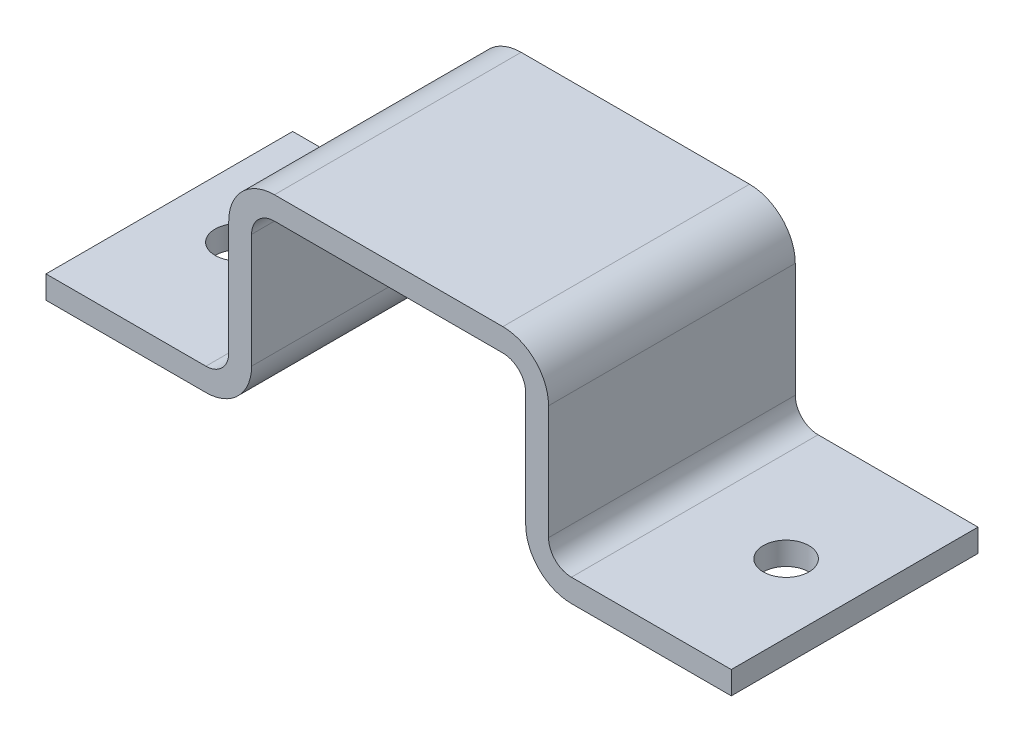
ISO-10303-21;
HEADER;
FILE_DESCRIPTION(('STEP AP214'),'2;1');
FILE_NAME('part.step','',(''),(''),'','','');
FILE_SCHEMA(('AUTOMOTIVE_DESIGN { 1 0 10303 214 1 1 1 1 }'));
ENDSEC;
DATA;
#1=APPLICATION_CONTEXT('core data for automotive mechanical design processes');
#2=APPLICATION_PROTOCOL_DEFINITION('international standard','automotive_design',2000,#1);
#3=PRODUCT_CONTEXT('',#1,'mechanical');
#4=PRODUCT('Part','Part','',(#3));
#5=PRODUCT_RELATED_PRODUCT_CATEGORY('part','',(#4));
#6=PRODUCT_DEFINITION_FORMATION('','',#4);
#7=PRODUCT_DEFINITION_CONTEXT('part definition',#1,'design');
#8=PRODUCT_DEFINITION('design','',#6,#7);
#9=PRODUCT_DEFINITION_SHAPE('','',#8);
#10=(LENGTH_UNIT() NAMED_UNIT(*) SI_UNIT(.MILLI.,.METRE.));
#11=(NAMED_UNIT(*) PLANE_ANGLE_UNIT() SI_UNIT($,.RADIAN.));
#12=(NAMED_UNIT(*) SI_UNIT($,.STERADIAN.) SOLID_ANGLE_UNIT());
#13=UNCERTAINTY_MEASURE_WITH_UNIT(LENGTH_MEASURE(1.E-05),#10,'distance_accuracy_value','');
#14=(GEOMETRIC_REPRESENTATION_CONTEXT(3) GLOBAL_UNCERTAINTY_ASSIGNED_CONTEXT((#13)) GLOBAL_UNIT_ASSIGNED_CONTEXT((#10,
#11,#12)) REPRESENTATION_CONTEXT('',''));
#15=CARTESIAN_POINT('',(0.,0.,0.));
#16=DIRECTION('',(0.,0.,1.));
#17=DIRECTION('',(1.,0.,0.));
#18=AXIS2_PLACEMENT_3D('',#15,#16,#17);
#19=CARTESIAN_POINT('',(40.,-40.,27.));
#20=DIRECTION('',(0.,1.,0.));
#21=DIRECTION('',(0.,0.,1.));
#22=AXIS2_PLACEMENT_3D('',#19,#20,#21);
#23=PLANE('',#22);
#24=CARTESIAN_POINT('',(60.,-40.,0.));
#25=DIRECTION('',(0.,1.,0.));
#26=DIRECTION('',(0.,0.,1.));
#27=AXIS2_PLACEMENT_3D('',#24,#25,#26);
#28=CIRCLE('',#27,5.);
#29=CARTESIAN_POINT('',(60.,-40.,5.));
#30=VERTEX_POINT('',#29);
#31=EDGE_CURVE('E369',#30,#30,#28,.T.);
#32=ORIENTED_EDGE('',*,*,#31,.T.);
#33=EDGE_LOOP('',(#32));
#34=FACE_BOUND('',#33,.T.);
#35=DIRECTION('',(1.,0.,0.));
#36=VECTOR('',#35,1.);
#37=CARTESIAN_POINT('',(40.,-40.,-27.));
#38=LINE('',#37,#36);
#39=CARTESIAN_POINT('',(40.,-40.,-27.));
#40=VERTEX_POINT('',#39);
#41=CARTESIAN_POINT('',(75.,-40.,-27.));
#42=VERTEX_POINT('',#41);
#43=EDGE_CURVE('E199',#40,#42,#38,.T.);
#44=ORIENTED_EDGE('',*,*,#43,.T.);
#45=DIRECTION('',(0.,0.,-1.));
#46=VECTOR('',#45,1.);
#47=CARTESIAN_POINT('',(75.,-40.,27.));
#48=LINE('',#47,#46);
#49=CARTESIAN_POINT('',(75.,-40.,27.));
#50=VERTEX_POINT('',#49);
#51=EDGE_CURVE('E11',#50,#42,#48,.T.);
#52=ORIENTED_EDGE('',*,*,#51,.F.);
#53=DIRECTION('',(1.,0.,0.));
#54=VECTOR('',#53,1.);
#55=CARTESIAN_POINT('',(40.,-40.,27.));
#56=LINE('',#55,#54);
#57=CARTESIAN_POINT('',(40.,-40.,27.));
#58=VERTEX_POINT('',#57);
#59=EDGE_CURVE('E124',#58,#50,#56,.T.);
#60=ORIENTED_EDGE('',*,*,#59,.F.);
#61=DIRECTION('',(0.,0.,-1.));
#62=VECTOR('',#61,1.);
#63=CARTESIAN_POINT('',(40.,-40.,27.));
#64=LINE('',#63,#62);
#65=EDGE_CURVE('E195',#58,#40,#64,.T.);
#66=ORIENTED_EDGE('',*,*,#65,.T.);
#67=EDGE_LOOP('',(#44,#52,#60,#66));
#68=FACE_BOUND('',#67,.T.);
#69=ADVANCED_FACE('F32',(#34,#68),#23,.F.);
#70=CARTESIAN_POINT('',(75.,-35.,27.));
#71=DIRECTION('',(1.,0.,0.));
#72=DIRECTION('',(0.,0.,-1.));
#73=AXIS2_PLACEMENT_3D('',#70,#71,#72);
#74=PLANE('',#73);
#75=DIRECTION('',(0.,-1.,0.));
#76=VECTOR('',#75,1.);
#77=CARTESIAN_POINT('',(75.,-35.,-27.));
#78=LINE('',#77,#76);
#79=CARTESIAN_POINT('',(75.,-35.,-27.));
#80=VERTEX_POINT('',#79);
#81=EDGE_CURVE('E202',#80,#42,#78,.T.);
#82=ORIENTED_EDGE('',*,*,#81,.F.);
#83=DIRECTION('',(0.,0.,-1.));
#84=VECTOR('',#83,1.);
#85=CARTESIAN_POINT('',(75.,-35.,27.));
#86=LINE('',#85,#84);
#87=CARTESIAN_POINT('',(75.,-35.,27.));
#88=VERTEX_POINT('',#87);
#89=EDGE_CURVE('E40',#88,#80,#86,.T.);
#90=ORIENTED_EDGE('',*,*,#89,.F.);
#91=DIRECTION('',(0.,-1.,0.));
#92=VECTOR('',#91,1.);
#93=CARTESIAN_POINT('',(75.,-35.,27.));
#94=LINE('',#93,#92);
#95=EDGE_CURVE('E305',#88,#50,#94,.T.);
#96=ORIENTED_EDGE('',*,*,#95,.T.);
#97=ORIENTED_EDGE('',*,*,#51,.T.);
#98=EDGE_LOOP('',(#82,#90,#96,#97));
#99=FACE_BOUND('',#98,.T.);
#100=ADVANCED_FACE('F292',(#99),#74,.T.);
#101=CARTESIAN_POINT('',(40.,-35.,27.));
#102=DIRECTION('',(0.,1.,0.));
#103=DIRECTION('',(0.,0.,1.));
#104=AXIS2_PLACEMENT_3D('',#101,#102,#103);
#105=PLANE('',#104);
#106=CARTESIAN_POINT('',(60.,-35.,0.));
#107=DIRECTION('',(0.,-1.,0.));
#108=DIRECTION('',(0.,0.,1.));
#109=AXIS2_PLACEMENT_3D('',#106,#107,#108);
#110=CIRCLE('',#109,5.);
#111=CARTESIAN_POINT('',(60.,-35.,5.));
#112=VERTEX_POINT('',#111);
#113=EDGE_CURVE('E371',#112,#112,#110,.T.);
#114=ORIENTED_EDGE('',*,*,#113,.T.);
#115=EDGE_LOOP('',(#114));
#116=FACE_BOUND('',#115,.T.);
#117=DIRECTION('',(1.,0.,0.));
#118=VECTOR('',#117,1.);
#119=CARTESIAN_POINT('',(40.,-35.,-27.));
#120=LINE('',#119,#118);
#121=CARTESIAN_POINT('',(40.,-35.,-27.));
#122=VERTEX_POINT('',#121);
#123=EDGE_CURVE('E206',#122,#80,#120,.T.);
#124=ORIENTED_EDGE('',*,*,#123,.F.);
#125=DIRECTION('',(0.,0.,-1.));
#126=VECTOR('',#125,1.);
#127=CARTESIAN_POINT('',(40.,-35.,27.));
#128=LINE('',#127,#126);
#129=CARTESIAN_POINT('',(40.,-35.,27.));
#130=VERTEX_POINT('',#129);
#131=EDGE_CURVE('E282',#130,#122,#128,.T.);
#132=ORIENTED_EDGE('',*,*,#131,.F.);
#133=DIRECTION('',(1.,0.,0.));
#134=VECTOR('',#133,1.);
#135=CARTESIAN_POINT('',(40.,-35.,27.));
#136=LINE('',#135,#134);
#137=EDGE_CURVE('E289',#130,#88,#136,.T.);
#138=ORIENTED_EDGE('',*,*,#137,.T.);
#139=ORIENTED_EDGE('',*,*,#89,.T.);
#140=EDGE_LOOP('',(#124,#132,#138,#139));
#141=FACE_BOUND('',#140,.T.);
#142=ADVANCED_FACE('F287',(#116,#141),#105,.T.);
#143=CARTESIAN_POINT('',(40.,-30.,27.));
#144=DIRECTION('',(0.,0.,-1.));
#145=DIRECTION('',(-1.,0.,0.));
#146=AXIS2_PLACEMENT_3D('',#143,#144,#145);
#147=CYLINDRICAL_SURFACE('',#146,5.);
#148=CARTESIAN_POINT('',(40.,-30.,-27.));
#149=DIRECTION('',(0.,0.,1.));
#150=DIRECTION('',(1.,0.,0.));
#151=AXIS2_PLACEMENT_3D('',#148,#149,#150);
#152=CIRCLE('',#151,5.);
#153=CARTESIAN_POINT('',(35.,-30.,-27.));
#154=VERTEX_POINT('',#153);
#155=EDGE_CURVE('E209',#154,#122,#152,.T.);
#156=ORIENTED_EDGE('',*,*,#155,.F.);
#157=DIRECTION('',(0.,0.,-1.));
#158=VECTOR('',#157,1.);
#159=CARTESIAN_POINT('',(35.,-30.,27.));
#160=LINE('',#159,#158);
#161=CARTESIAN_POINT('',(35.,-30.,27.));
#162=VERTEX_POINT('',#161);
#163=EDGE_CURVE('E280',#162,#154,#160,.T.);
#164=ORIENTED_EDGE('',*,*,#163,.F.);
#165=CARTESIAN_POINT('',(40.,-30.,27.));
#166=DIRECTION('',(0.,0.,1.));
#167=DIRECTION('',(1.,0.,0.));
#168=AXIS2_PLACEMENT_3D('',#165,#166,#167);
#169=CIRCLE('',#168,5.);
#170=EDGE_CURVE('E302',#162,#130,#169,.T.);
#171=ORIENTED_EDGE('',*,*,#170,.T.);
#172=ORIENTED_EDGE('',*,*,#131,.T.);
#173=EDGE_LOOP('',(#156,#164,#171,#172));
#174=FACE_BOUND('',#173,.T.);
#175=ADVANCED_FACE('F299',(#174),#147,.F.);
#176=CARTESIAN_POINT('',(35.,-5.,27.));
#177=DIRECTION('',(1.,0.,0.));
#178=DIRECTION('',(0.,1.,0.));
#179=AXIS2_PLACEMENT_3D('',#176,#177,#178);
#180=PLANE('',#179);
#181=DIRECTION('',(0.,-1.,0.));
#182=VECTOR('',#181,1.);
#183=CARTESIAN_POINT('',(35.,-5.,-27.));
#184=LINE('',#183,#182);
#185=CARTESIAN_POINT('',(35.,-5.,-27.));
#186=VERTEX_POINT('',#185);
#187=EDGE_CURVE('E212',#186,#154,#184,.T.);
#188=ORIENTED_EDGE('',*,*,#187,.F.);
#189=DIRECTION('',(0.,0.,-1.));
#190=VECTOR('',#189,1.);
#191=CARTESIAN_POINT('',(35.,-5.,27.));
#192=LINE('',#191,#190);
#193=CARTESIAN_POINT('',(35.,-5.,27.));
#194=VERTEX_POINT('',#193);
#195=EDGE_CURVE('E278',#194,#186,#192,.T.);
#196=ORIENTED_EDGE('',*,*,#195,.F.);
#197=DIRECTION('',(0.,-1.,0.));
#198=VECTOR('',#197,1.);
#199=CARTESIAN_POINT('',(35.,-5.,27.));
#200=LINE('',#199,#198);
#201=EDGE_CURVE('E307',#194,#162,#200,.T.);
#202=ORIENTED_EDGE('',*,*,#201,.T.);
#203=ORIENTED_EDGE('',*,*,#163,.T.);
#204=EDGE_LOOP('',(#188,#196,#202,#203));
#205=FACE_BOUND('',#204,.T.);
#206=ADVANCED_FACE('F437',(#205),#180,.T.);
#207=CARTESIAN_POINT('',(25.,-5.,27.));
#208=DIRECTION('',(0.,0.,-1.));
#209=DIRECTION('',(-1.,0.,0.));
#210=AXIS2_PLACEMENT_3D('',#207,#208,#209);
#211=CYLINDRICAL_SURFACE('',#210,10.);
#212=CARTESIAN_POINT('',(25.,-5.,-27.));
#213=DIRECTION('',(0.,0.,1.));
#214=DIRECTION('',(1.,0.,0.));
#215=AXIS2_PLACEMENT_3D('',#212,#213,#214);
#216=CIRCLE('',#215,10.);
#217=CARTESIAN_POINT('',(25.,5.,-27.));
#218=VERTEX_POINT('',#217);
#219=EDGE_CURVE('E215',#218,#186,#216,.F.);
#220=ORIENTED_EDGE('',*,*,#219,.F.);
#221=DIRECTION('',(0.,0.,-1.));
#222=VECTOR('',#221,1.);
#223=CARTESIAN_POINT('',(25.,5.,27.));
#224=LINE('',#223,#222);
#225=CARTESIAN_POINT('',(25.,5.,27.));
#226=VERTEX_POINT('',#225);
#227=EDGE_CURVE('E276',#226,#218,#224,.T.);
#228=ORIENTED_EDGE('',*,*,#227,.F.);
#229=CARTESIAN_POINT('',(25.,-5.,27.));
#230=DIRECTION('',(0.,0.,1.));
#231=DIRECTION('',(1.,0.,0.));
#232=AXIS2_PLACEMENT_3D('',#229,#230,#231);
#233=CIRCLE('',#232,10.);
#234=EDGE_CURVE('E313',#226,#194,#233,.F.);
#235=ORIENTED_EDGE('',*,*,#234,.T.);
#236=ORIENTED_EDGE('',*,*,#195,.T.);
#237=EDGE_LOOP('',(#220,#228,#235,#236));
#238=FACE_BOUND('',#237,.T.);
#239=ADVANCED_FACE('F433',(#238),#211,.T.);
#240=CARTESIAN_POINT('',(-25.,5.,27.));
#241=DIRECTION('',(0.,1.,0.));
#242=DIRECTION('',(0.,0.,1.));
#243=AXIS2_PLACEMENT_3D('',#240,#241,#242);
#244=PLANE('',#243);
#245=DIRECTION('',(1.,0.,0.));
#246=VECTOR('',#245,1.);
#247=CARTESIAN_POINT('',(-25.,5.,-27.));
#248=LINE('',#247,#246);
#249=CARTESIAN_POINT('',(-25.,5.,-27.));
#250=VERTEX_POINT('',#249);
#251=EDGE_CURVE('E218',#250,#218,#248,.T.);
#252=ORIENTED_EDGE('',*,*,#251,.F.);
#253=DIRECTION('',(0.,0.,-1.));
#254=VECTOR('',#253,1.);
#255=CARTESIAN_POINT('',(-25.,5.,27.));
#256=LINE('',#255,#254);
#257=CARTESIAN_POINT('',(-25.,5.,27.));
#258=VERTEX_POINT('',#257);
#259=EDGE_CURVE('E274',#258,#250,#256,.T.);
#260=ORIENTED_EDGE('',*,*,#259,.F.);
#261=DIRECTION('',(1.,0.,0.));
#262=VECTOR('',#261,1.);
#263=CARTESIAN_POINT('',(-25.,5.,27.));
#264=LINE('',#263,#262);
#265=EDGE_CURVE('E316',#258,#226,#264,.T.);
#266=ORIENTED_EDGE('',*,*,#265,.T.);
#267=ORIENTED_EDGE('',*,*,#227,.T.);
#268=EDGE_LOOP('',(#252,#260,#266,#267));
#269=FACE_BOUND('',#268,.T.);
#270=ADVANCED_FACE('F429',(#269),#244,.T.);
#271=CARTESIAN_POINT('',(-25.,-5.,27.));
#272=DIRECTION('',(0.,0.,-1.));
#273=DIRECTION('',(-1.,0.,0.));
#274=AXIS2_PLACEMENT_3D('',#271,#272,#273);
#275=CYLINDRICAL_SURFACE('',#274,10.);
#276=CARTESIAN_POINT('',(-25.,-5.,-27.));
#277=DIRECTION('',(0.,0.,1.));
#278=DIRECTION('',(1.,0.,0.));
#279=AXIS2_PLACEMENT_3D('',#276,#277,#278);
#280=CIRCLE('',#279,10.);
#281=CARTESIAN_POINT('',(-35.,-5.,-27.));
#282=VERTEX_POINT('',#281);
#283=EDGE_CURVE('E221',#282,#250,#280,.F.);
#284=ORIENTED_EDGE('',*,*,#283,.F.);
#285=DIRECTION('',(0.,0.,-1.));
#286=VECTOR('',#285,1.);
#287=CARTESIAN_POINT('',(-35.,-5.,27.));
#288=LINE('',#287,#286);
#289=CARTESIAN_POINT('',(-35.,-5.,27.));
#290=VERTEX_POINT('',#289);
#291=EDGE_CURVE('E272',#290,#282,#288,.T.);
#292=ORIENTED_EDGE('',*,*,#291,.F.);
#293=CARTESIAN_POINT('',(-25.,-5.,27.));
#294=DIRECTION('',(0.,0.,1.));
#295=DIRECTION('',(1.,0.,0.));
#296=AXIS2_PLACEMENT_3D('',#293,#294,#295);
#297=CIRCLE('',#296,10.);
#298=EDGE_CURVE('E319',#290,#258,#297,.F.);
#299=ORIENTED_EDGE('',*,*,#298,.T.);
#300=ORIENTED_EDGE('',*,*,#259,.T.);
#301=EDGE_LOOP('',(#284,#292,#299,#300));
#302=FACE_BOUND('',#301,.T.);
#303=ADVANCED_FACE('F425',(#302),#275,.T.);
#304=CARTESIAN_POINT('',(-35.,-30.,27.));
#305=DIRECTION('',(-1.,0.,0.));
#306=DIRECTION('',(0.,-1.,0.));
#307=AXIS2_PLACEMENT_3D('',#304,#305,#306);
#308=PLANE('',#307);
#309=DIRECTION('',(0.,1.,0.));
#310=VECTOR('',#309,1.);
#311=CARTESIAN_POINT('',(-35.,-30.,-27.));
#312=LINE('',#311,#310);
#313=CARTESIAN_POINT('',(-35.,-30.,-27.));
#314=VERTEX_POINT('',#313);
#315=EDGE_CURVE('E224',#314,#282,#312,.T.);
#316=ORIENTED_EDGE('',*,*,#315,.F.);
#317=DIRECTION('',(0.,0.,-1.));
#318=VECTOR('',#317,1.);
#319=CARTESIAN_POINT('',(-35.,-30.,27.));
#320=LINE('',#319,#318);
#321=CARTESIAN_POINT('',(-35.,-30.,27.));
#322=VERTEX_POINT('',#321);
#323=EDGE_CURVE('E270',#322,#314,#320,.T.);
#324=ORIENTED_EDGE('',*,*,#323,.F.);
#325=DIRECTION('',(0.,1.,0.));
#326=VECTOR('',#325,1.);
#327=CARTESIAN_POINT('',(-35.,-30.,27.));
#328=LINE('',#327,#326);
#329=EDGE_CURVE('E322',#322,#290,#328,.T.);
#330=ORIENTED_EDGE('',*,*,#329,.T.);
#331=ORIENTED_EDGE('',*,*,#291,.T.);
#332=EDGE_LOOP('',(#316,#324,#330,#331));
#333=FACE_BOUND('',#332,.T.);
#334=ADVANCED_FACE('F421',(#333),#308,.T.);
#335=CARTESIAN_POINT('',(-40.,-30.,27.));
#336=DIRECTION('',(0.,0.,-1.));
#337=DIRECTION('',(-1.,0.,0.));
#338=AXIS2_PLACEMENT_3D('',#335,#336,#337);
#339=CYLINDRICAL_SURFACE('',#338,5.);
#340=CARTESIAN_POINT('',(-40.,-30.,-27.));
#341=DIRECTION('',(0.,0.,1.));
#342=DIRECTION('',(1.,0.,0.));
#343=AXIS2_PLACEMENT_3D('',#340,#341,#342);
#344=CIRCLE('',#343,5.);
#345=CARTESIAN_POINT('',(-40.,-35.,-27.));
#346=VERTEX_POINT('',#345);
#347=EDGE_CURVE('E227',#346,#314,#344,.T.);
#348=ORIENTED_EDGE('',*,*,#347,.F.);
#349=DIRECTION('',(0.,0.,-1.));
#350=VECTOR('',#349,1.);
#351=CARTESIAN_POINT('',(-40.,-35.,27.));
#352=LINE('',#351,#350);
#353=CARTESIAN_POINT('',(-40.,-35.,27.));
#354=VERTEX_POINT('',#353);
#355=EDGE_CURVE('E268',#354,#346,#352,.T.);
#356=ORIENTED_EDGE('',*,*,#355,.F.);
#357=CARTESIAN_POINT('',(-40.,-30.,27.));
#358=DIRECTION('',(0.,0.,1.));
#359=DIRECTION('',(1.,0.,0.));
#360=AXIS2_PLACEMENT_3D('',#357,#358,#359);
#361=CIRCLE('',#360,5.);
#362=EDGE_CURVE('E325',#354,#322,#361,.T.);
#363=ORIENTED_EDGE('',*,*,#362,.T.);
#364=ORIENTED_EDGE('',*,*,#323,.T.);
#365=EDGE_LOOP('',(#348,#356,#363,#364));
#366=FACE_BOUND('',#365,.T.);
#367=ADVANCED_FACE('F417',(#366),#339,.F.);
#368=CARTESIAN_POINT('',(-75.,-35.,27.));
#369=DIRECTION('',(0.,1.,0.));
#370=DIRECTION('',(0.,0.,1.));
#371=AXIS2_PLACEMENT_3D('',#368,#369,#370);
#372=PLANE('',#371);
#373=CARTESIAN_POINT('',(-60.,-35.,0.));
#374=DIRECTION('',(0.,1.,0.));
#375=DIRECTION('',(0.,0.,1.));
#376=AXIS2_PLACEMENT_3D('',#373,#374,#375);
#377=CIRCLE('',#376,5.);
#378=CARTESIAN_POINT('',(-60.,-35.,5.));
#379=VERTEX_POINT('',#378);
#380=EDGE_CURVE('E374',#379,#379,#377,.T.);
#381=ORIENTED_EDGE('',*,*,#380,.F.);
#382=EDGE_LOOP('',(#381));
#383=FACE_BOUND('',#382,.T.);
#384=DIRECTION('',(1.,0.,0.));
#385=VECTOR('',#384,1.);
#386=CARTESIAN_POINT('',(-75.,-35.,-27.));
#387=LINE('',#386,#385);
#388=CARTESIAN_POINT('',(-75.,-35.,-27.));
#389=VERTEX_POINT('',#388);
#390=EDGE_CURVE('E230',#389,#346,#387,.T.);
#391=ORIENTED_EDGE('',*,*,#390,.F.);
#392=DIRECTION('',(0.,0.,-1.));
#393=VECTOR('',#392,1.);
#394=CARTESIAN_POINT('',(-75.,-35.,27.));
#395=LINE('',#394,#393);
#396=CARTESIAN_POINT('',(-75.,-35.,27.));
#397=VERTEX_POINT('',#396);
#398=EDGE_CURVE('E266',#397,#389,#395,.T.);
#399=ORIENTED_EDGE('',*,*,#398,.F.);
#400=DIRECTION('',(1.,0.,0.));
#401=VECTOR('',#400,1.);
#402=CARTESIAN_POINT('',(-75.,-35.,27.));
#403=LINE('',#402,#401);
#404=EDGE_CURVE('E328',#397,#354,#403,.T.);
#405=ORIENTED_EDGE('',*,*,#404,.T.);
#406=ORIENTED_EDGE('',*,*,#355,.T.);
#407=EDGE_LOOP('',(#391,#399,#405,#406));
#408=FACE_BOUND('',#407,.T.);
#409=ADVANCED_FACE('F413',(#383,#408),#372,.T.);
#410=CARTESIAN_POINT('',(-75.,-40.,27.));
#411=DIRECTION('',(-1.,0.,0.));
#412=DIRECTION('',(0.,0.,1.));
#413=AXIS2_PLACEMENT_3D('',#410,#411,#412);
#414=PLANE('',#413);
#415=DIRECTION('',(0.,1.,0.));
#416=VECTOR('',#415,1.);
#417=CARTESIAN_POINT('',(-75.,-40.,-27.));
#418=LINE('',#417,#416);
#419=CARTESIAN_POINT('',(-75.,-40.,-27.));
#420=VERTEX_POINT('',#419);
#421=EDGE_CURVE('E233',#420,#389,#418,.T.);
#422=ORIENTED_EDGE('',*,*,#421,.F.);
#423=DIRECTION('',(0.,0.,-1.));
#424=VECTOR('',#423,1.);
#425=CARTESIAN_POINT('',(-75.,-40.,27.));
#426=LINE('',#425,#424);
#427=CARTESIAN_POINT('',(-75.,-40.,27.));
#428=VERTEX_POINT('',#427);
#429=EDGE_CURVE('E264',#428,#420,#426,.T.);
#430=ORIENTED_EDGE('',*,*,#429,.F.);
#431=DIRECTION('',(0.,1.,0.));
#432=VECTOR('',#431,1.);
#433=CARTESIAN_POINT('',(-75.,-40.,27.));
#434=LINE('',#433,#432);
#435=EDGE_CURVE('E331',#428,#397,#434,.T.);
#436=ORIENTED_EDGE('',*,*,#435,.T.);
#437=ORIENTED_EDGE('',*,*,#398,.T.);
#438=EDGE_LOOP('',(#422,#430,#436,#437));
#439=FACE_BOUND('',#438,.T.);
#440=ADVANCED_FACE('F388',(#439),#414,.T.);
#441=CARTESIAN_POINT('',(-75.,-40.,27.));
#442=DIRECTION('',(0.,1.,0.));
#443=DIRECTION('',(0.,0.,1.));
#444=AXIS2_PLACEMENT_3D('',#441,#442,#443);
#445=PLANE('',#444);
#446=CARTESIAN_POINT('',(-60.,-40.,0.));
#447=DIRECTION('',(0.,1.,0.));
#448=DIRECTION('',(0.,0.,1.));
#449=AXIS2_PLACEMENT_3D('',#446,#447,#448);
#450=CIRCLE('',#449,5.);
#451=CARTESIAN_POINT('',(-60.,-40.,5.));
#452=VERTEX_POINT('',#451);
#453=EDGE_CURVE('E203',#452,#452,#450,.F.);
#454=ORIENTED_EDGE('',*,*,#453,.F.);
#455=EDGE_LOOP('',(#454));
#456=FACE_BOUND('',#455,.T.);
#457=DIRECTION('',(1.,0.,0.));
#458=VECTOR('',#457,1.);
#459=CARTESIAN_POINT('',(-75.,-40.,-27.));
#460=LINE('',#459,#458);
#461=CARTESIAN_POINT('',(-40.,-40.,-27.));
#462=VERTEX_POINT('',#461);
#463=EDGE_CURVE('E236',#420,#462,#460,.T.);
#464=ORIENTED_EDGE('',*,*,#463,.T.);
#465=DIRECTION('',(0.,0.,-1.));
#466=VECTOR('',#465,1.);
#467=CARTESIAN_POINT('',(-40.,-40.,27.));
#468=LINE('',#467,#466);
#469=CARTESIAN_POINT('',(-40.,-40.,27.));
#470=VERTEX_POINT('',#469);
#471=EDGE_CURVE('E261',#470,#462,#468,.T.);
#472=ORIENTED_EDGE('',*,*,#471,.F.);
#473=DIRECTION('',(1.,0.,0.));
#474=VECTOR('',#473,1.);
#475=CARTESIAN_POINT('',(-75.,-40.,27.));
#476=LINE('',#475,#474);
#477=EDGE_CURVE('E334',#428,#470,#476,.T.);
#478=ORIENTED_EDGE('',*,*,#477,.F.);
#479=ORIENTED_EDGE('',*,*,#429,.T.);
#480=EDGE_LOOP('',(#464,#472,#478,#479));
#481=FACE_BOUND('',#480,.T.);
#482=ADVANCED_FACE('F384',(#456,#481),#445,.F.);
#483=CARTESIAN_POINT('',(-40.,-30.,27.));
#484=DIRECTION('',(0.,0.,-1.));
#485=DIRECTION('',(-1.,0.,0.));
#486=AXIS2_PLACEMENT_3D('',#483,#484,#485);
#487=CYLINDRICAL_SURFACE('',#486,10.);
#488=CARTESIAN_POINT('',(-40.,-30.,-27.));
#489=DIRECTION('',(0.,0.,1.));
#490=DIRECTION('',(1.,0.,0.));
#491=AXIS2_PLACEMENT_3D('',#488,#489,#490);
#492=CIRCLE('',#491,10.);
#493=CARTESIAN_POINT('',(-30.,-30.,-27.));
#494=VERTEX_POINT('',#493);
#495=EDGE_CURVE('E238',#462,#494,#492,.T.);
#496=ORIENTED_EDGE('',*,*,#495,.T.);
#497=DIRECTION('',(0.,0.,-1.));
#498=VECTOR('',#497,1.);
#499=CARTESIAN_POINT('',(-30.,-30.,27.));
#500=LINE('',#499,#498);
#501=CARTESIAN_POINT('',(-30.,-30.,27.));
#502=VERTEX_POINT('',#501);
#503=EDGE_CURVE('E258',#502,#494,#500,.T.);
#504=ORIENTED_EDGE('',*,*,#503,.F.);
#505=CARTESIAN_POINT('',(-40.,-30.,27.));
#506=DIRECTION('',(0.,0.,1.));
#507=DIRECTION('',(1.,0.,0.));
#508=AXIS2_PLACEMENT_3D('',#505,#506,#507);
#509=CIRCLE('',#508,10.);
#510=EDGE_CURVE('E336',#470,#502,#509,.T.);
#511=ORIENTED_EDGE('',*,*,#510,.F.);
#512=ORIENTED_EDGE('',*,*,#471,.T.);
#513=EDGE_LOOP('',(#496,#504,#511,#512));
#514=FACE_BOUND('',#513,.T.);
#515=ADVANCED_FACE('F387',(#514),#487,.T.);
#516=CARTESIAN_POINT('',(-30.,-30.,27.));
#517=DIRECTION('',(-1.,0.,0.));
#518=DIRECTION('',(0.,-1.,0.));
#519=AXIS2_PLACEMENT_3D('',#516,#517,#518);
#520=PLANE('',#519);
#521=DIRECTION('',(0.,1.,0.));
#522=VECTOR('',#521,1.);
#523=CARTESIAN_POINT('',(-30.,-30.,-27.));
#524=LINE('',#523,#522);
#525=CARTESIAN_POINT('',(-30.,-5.,-27.));
#526=VERTEX_POINT('',#525);
#527=EDGE_CURVE('E240',#494,#526,#524,.T.);
#528=ORIENTED_EDGE('',*,*,#527,.T.);
#529=DIRECTION('',(0.,0.,-1.));
#530=VECTOR('',#529,1.);
#531=CARTESIAN_POINT('',(-30.,-5.,27.));
#532=LINE('',#531,#530);
#533=CARTESIAN_POINT('',(-30.,-5.,27.));
#534=VERTEX_POINT('',#533);
#535=EDGE_CURVE('E255',#534,#526,#532,.T.);
#536=ORIENTED_EDGE('',*,*,#535,.F.);
#537=DIRECTION('',(0.,1.,0.));
#538=VECTOR('',#537,1.);
#539=CARTESIAN_POINT('',(-30.,-30.,27.));
#540=LINE('',#539,#538);
#541=EDGE_CURVE('E338',#502,#534,#540,.T.);
#542=ORIENTED_EDGE('',*,*,#541,.F.);
#543=ORIENTED_EDGE('',*,*,#503,.T.);
#544=EDGE_LOOP('',(#528,#536,#542,#543));
#545=FACE_BOUND('',#544,.T.);
#546=ADVANCED_FACE('F400',(#545),#520,.F.);
#547=CARTESIAN_POINT('',(-25.,-5.,27.));
#548=DIRECTION('',(0.,0.,-1.));
#549=DIRECTION('',(-1.,0.,0.));
#550=AXIS2_PLACEMENT_3D('',#547,#548,#549);
#551=CYLINDRICAL_SURFACE('',#550,5.);
#552=CARTESIAN_POINT('',(-25.,-5.,-27.));
#553=DIRECTION('',(0.,0.,-1.));
#554=DIRECTION('',(-1.,0.,0.));
#555=AXIS2_PLACEMENT_3D('',#552,#553,#554);
#556=CIRCLE('',#555,5.);
#557=CARTESIAN_POINT('',(-25.,0.,-27.));
#558=VERTEX_POINT('',#557);
#559=EDGE_CURVE('E242',#526,#558,#556,.T.);
#560=ORIENTED_EDGE('',*,*,#559,.T.);
#561=DIRECTION('',(0.,0.,-1.));
#562=VECTOR('',#561,1.);
#563=CARTESIAN_POINT('',(-25.,0.,27.));
#564=LINE('',#563,#562);
#565=CARTESIAN_POINT('',(-25.,0.,27.));
#566=VERTEX_POINT('',#565);
#567=EDGE_CURVE('E252',#566,#558,#564,.T.);
#568=ORIENTED_EDGE('',*,*,#567,.F.);
#569=CARTESIAN_POINT('',(-25.,-5.,27.));
#570=DIRECTION('',(0.,0.,-1.));
#571=DIRECTION('',(-1.,0.,0.));
#572=AXIS2_PLACEMENT_3D('',#569,#570,#571);
#573=CIRCLE('',#572,5.);
#574=EDGE_CURVE('E340',#534,#566,#573,.T.);
#575=ORIENTED_EDGE('',*,*,#574,.F.);
#576=ORIENTED_EDGE('',*,*,#535,.T.);
#577=EDGE_LOOP('',(#560,#568,#575,#576));
#578=FACE_BOUND('',#577,.T.);
#579=ADVANCED_FACE('F346',(#578),#551,.F.);
#580=CARTESIAN_POINT('',(-25.,0.,27.));
#581=DIRECTION('',(0.,1.,0.));
#582=DIRECTION('',(0.,0.,1.));
#583=AXIS2_PLACEMENT_3D('',#580,#581,#582);
#584=PLANE('',#583);
#585=DIRECTION('',(1.,0.,0.));
#586=VECTOR('',#585,1.);
#587=CARTESIAN_POINT('',(-25.,0.,-27.));
#588=LINE('',#587,#586);
#589=CARTESIAN_POINT('',(25.,0.,-27.));
#590=VERTEX_POINT('',#589);
#591=EDGE_CURVE('E244',#558,#590,#588,.T.);
#592=ORIENTED_EDGE('',*,*,#591,.T.);
#593=DIRECTION('',(0.,0.,-1.));
#594=VECTOR('',#593,1.);
#595=CARTESIAN_POINT('',(25.,0.,27.));
#596=LINE('',#595,#594);
#597=CARTESIAN_POINT('',(25.,0.,27.));
#598=VERTEX_POINT('',#597);
#599=EDGE_CURVE('E190',#598,#590,#596,.T.);
#600=ORIENTED_EDGE('',*,*,#599,.F.);
#601=DIRECTION('',(1.,0.,0.));
#602=VECTOR('',#601,1.);
#603=CARTESIAN_POINT('',(-25.,0.,27.));
#604=LINE('',#603,#602);
#605=EDGE_CURVE('E181',#566,#598,#604,.T.);
#606=ORIENTED_EDGE('',*,*,#605,.F.);
#607=ORIENTED_EDGE('',*,*,#567,.T.);
#608=EDGE_LOOP('',(#592,#600,#606,#607));
#609=FACE_BOUND('',#608,.T.);
#610=ADVANCED_FACE('F350',(#609),#584,.F.);
#611=CARTESIAN_POINT('',(25.,-5.,27.));
#612=DIRECTION('',(0.,0.,-1.));
#613=DIRECTION('',(-1.,0.,0.));
#614=AXIS2_PLACEMENT_3D('',#611,#612,#613);
#615=CYLINDRICAL_SURFACE('',#614,5.);
#616=CARTESIAN_POINT('',(25.,-5.,-27.));
#617=DIRECTION('',(0.,0.,-1.));
#618=DIRECTION('',(-1.,0.,0.));
#619=AXIS2_PLACEMENT_3D('',#616,#617,#618);
#620=CIRCLE('',#619,5.);
#621=CARTESIAN_POINT('',(30.,-5.,-27.));
#622=VERTEX_POINT('',#621);
#623=EDGE_CURVE('E189',#590,#622,#620,.T.);
#624=ORIENTED_EDGE('',*,*,#623,.T.);
#625=DIRECTION('',(0.,0.,-1.));
#626=VECTOR('',#625,1.);
#627=CARTESIAN_POINT('',(30.,-5.,27.));
#628=LINE('',#627,#626);
#629=CARTESIAN_POINT('',(30.,-5.,27.));
#630=VERTEX_POINT('',#629);
#631=EDGE_CURVE('E186',#630,#622,#628,.T.);
#632=ORIENTED_EDGE('',*,*,#631,.F.);
#633=CARTESIAN_POINT('',(25.,-5.,27.));
#634=DIRECTION('',(0.,0.,-1.));
#635=DIRECTION('',(-1.,0.,0.));
#636=AXIS2_PLACEMENT_3D('',#633,#634,#635);
#637=CIRCLE('',#636,5.);
#638=EDGE_CURVE('E175',#598,#630,#637,.T.);
#639=ORIENTED_EDGE('',*,*,#638,.F.);
#640=ORIENTED_EDGE('',*,*,#599,.T.);
#641=EDGE_LOOP('',(#624,#632,#639,#640));
#642=FACE_BOUND('',#641,.T.);
#643=ADVANCED_FACE('F187',(#642),#615,.F.);
#644=CARTESIAN_POINT('',(30.,-5.,27.));
#645=DIRECTION('',(1.,0.,0.));
#646=DIRECTION('',(0.,1.,0.));
#647=AXIS2_PLACEMENT_3D('',#644,#645,#646);
#648=PLANE('',#647);
#649=DIRECTION('',(0.,-1.,0.));
#650=VECTOR('',#649,1.);
#651=CARTESIAN_POINT('',(30.,-5.,-27.));
#652=LINE('',#651,#650);
#653=CARTESIAN_POINT('',(30.,-30.,-27.));
#654=VERTEX_POINT('',#653);
#655=EDGE_CURVE('E112',#622,#654,#652,.T.);
#656=ORIENTED_EDGE('',*,*,#655,.T.);
#657=DIRECTION('',(0.,0.,-1.));
#658=VECTOR('',#657,1.);
#659=CARTESIAN_POINT('',(30.,-30.,27.));
#660=LINE('',#659,#658);
#661=CARTESIAN_POINT('',(30.,-30.,27.));
#662=VERTEX_POINT('',#661);
#663=EDGE_CURVE('E191',#662,#654,#660,.T.);
#664=ORIENTED_EDGE('',*,*,#663,.F.);
#665=DIRECTION('',(0.,-1.,0.));
#666=VECTOR('',#665,1.);
#667=CARTESIAN_POINT('',(30.,-5.,27.));
#668=LINE('',#667,#666);
#669=EDGE_CURVE('E179',#630,#662,#668,.T.);
#670=ORIENTED_EDGE('',*,*,#669,.F.);
#671=ORIENTED_EDGE('',*,*,#631,.T.);
#672=EDGE_LOOP('',(#656,#664,#670,#671));
#673=FACE_BOUND('',#672,.T.);
#674=ADVANCED_FACE('F193',(#673),#648,.F.);
#675=CARTESIAN_POINT('',(40.,-30.,27.));
#676=DIRECTION('',(0.,0.,-1.));
#677=DIRECTION('',(-1.,0.,0.));
#678=AXIS2_PLACEMENT_3D('',#675,#676,#677);
#679=CYLINDRICAL_SURFACE('',#678,10.);
#680=CARTESIAN_POINT('',(40.,-30.,-27.));
#681=DIRECTION('',(0.,0.,1.));
#682=DIRECTION('',(1.,0.,0.));
#683=AXIS2_PLACEMENT_3D('',#680,#681,#682);
#684=CIRCLE('',#683,10.);
#685=EDGE_CURVE('E118',#654,#40,#684,.T.);
#686=ORIENTED_EDGE('',*,*,#685,.T.);
#687=ORIENTED_EDGE('',*,*,#65,.F.);
#688=CARTESIAN_POINT('',(40.,-30.,27.));
#689=DIRECTION('',(0.,0.,1.));
#690=DIRECTION('',(1.,0.,0.));
#691=AXIS2_PLACEMENT_3D('',#688,#689,#690);
#692=CIRCLE('',#691,10.);
#693=EDGE_CURVE('E48',#662,#58,#692,.T.);
#694=ORIENTED_EDGE('',*,*,#693,.F.);
#695=ORIENTED_EDGE('',*,*,#663,.T.);
#696=EDGE_LOOP('',(#686,#687,#694,#695));
#697=FACE_BOUND('',#696,.T.);
#698=ADVANCED_FACE('F352',(#697),#679,.T.);
#699=CARTESIAN_POINT('',(40.,-30.,27.));
#700=DIRECTION('',(0.,0.,1.));
#701=DIRECTION('',(1.,0.,0.));
#702=AXIS2_PLACEMENT_3D('',#699,#700,#701);
#703=PLANE('',#702);
#704=ORIENTED_EDGE('',*,*,#59,.T.);
#705=ORIENTED_EDGE('',*,*,#95,.F.);
#706=ORIENTED_EDGE('',*,*,#137,.F.);
#707=ORIENTED_EDGE('',*,*,#170,.F.);
#708=ORIENTED_EDGE('',*,*,#201,.F.);
#709=ORIENTED_EDGE('',*,*,#234,.F.);
#710=ORIENTED_EDGE('',*,*,#265,.F.);
#711=ORIENTED_EDGE('',*,*,#298,.F.);
#712=ORIENTED_EDGE('',*,*,#329,.F.);
#713=ORIENTED_EDGE('',*,*,#362,.F.);
#714=ORIENTED_EDGE('',*,*,#404,.F.);
#715=ORIENTED_EDGE('',*,*,#435,.F.);
#716=ORIENTED_EDGE('',*,*,#477,.T.);
#717=ORIENTED_EDGE('',*,*,#510,.T.);
#718=ORIENTED_EDGE('',*,*,#541,.T.);
#719=ORIENTED_EDGE('',*,*,#574,.T.);
#720=ORIENTED_EDGE('',*,*,#605,.T.);
#721=ORIENTED_EDGE('',*,*,#638,.T.);
#722=ORIENTED_EDGE('',*,*,#669,.T.);
#723=ORIENTED_EDGE('',*,*,#693,.T.);
#724=EDGE_LOOP('',(#704,#705,#706,#707,#708,#709,#710,#711,#712,#713,#714,#715,#716,#717,#718,
#719,#720,#721,#722,#723));
#725=FACE_BOUND('',#724,.T.);
#726=ADVANCED_FACE('F177',(#725),#703,.T.);
#727=CARTESIAN_POINT('',(40.,-30.,-27.));
#728=DIRECTION('',(0.,0.,1.));
#729=DIRECTION('',(1.,0.,0.));
#730=AXIS2_PLACEMENT_3D('',#727,#728,#729);
#731=PLANE('',#730);
#732=ORIENTED_EDGE('',*,*,#43,.F.);
#733=ORIENTED_EDGE('',*,*,#685,.F.);
#734=ORIENTED_EDGE('',*,*,#655,.F.);
#735=ORIENTED_EDGE('',*,*,#623,.F.);
#736=ORIENTED_EDGE('',*,*,#591,.F.);
#737=ORIENTED_EDGE('',*,*,#559,.F.);
#738=ORIENTED_EDGE('',*,*,#527,.F.);
#739=ORIENTED_EDGE('',*,*,#495,.F.);
#740=ORIENTED_EDGE('',*,*,#463,.F.);
#741=ORIENTED_EDGE('',*,*,#421,.T.);
#742=ORIENTED_EDGE('',*,*,#390,.T.);
#743=ORIENTED_EDGE('',*,*,#347,.T.);
#744=ORIENTED_EDGE('',*,*,#315,.T.);
#745=ORIENTED_EDGE('',*,*,#283,.T.);
#746=ORIENTED_EDGE('',*,*,#251,.T.);
#747=ORIENTED_EDGE('',*,*,#219,.T.);
#748=ORIENTED_EDGE('',*,*,#187,.T.);
#749=ORIENTED_EDGE('',*,*,#155,.T.);
#750=ORIENTED_EDGE('',*,*,#123,.T.);
#751=ORIENTED_EDGE('',*,*,#81,.T.);
#752=EDGE_LOOP('',(#732,#733,#734,#735,#736,#737,#738,#739,#740,#741,#742,#743,#744,#745,#746,
#747,#748,#749,#750,#751));
#753=FACE_BOUND('',#752,.T.);
#754=ADVANCED_FACE('F295',(#753),#731,.F.);
#755=CARTESIAN_POINT('',(-60.,-40.001,0.));
#756=DIRECTION('',(0.,1.,0.));
#757=DIRECTION('',(0.,0.,1.));
#758=AXIS2_PLACEMENT_3D('',#755,#756,#757);
#759=CYLINDRICAL_SURFACE('',#758,5.);
#760=ORIENTED_EDGE('',*,*,#380,.T.);
#761=EDGE_LOOP('',(#760));
#762=FACE_BOUND('',#761,.T.);
#763=ORIENTED_EDGE('',*,*,#453,.T.);
#764=EDGE_LOOP('',(#763));
#765=FACE_BOUND('',#764,.T.);
#766=ADVANCED_FACE('F382',(#762,#765),#759,.F.);
#767=CARTESIAN_POINT('',(60.,-40.001,0.));
#768=DIRECTION('',(0.,1.,0.));
#769=DIRECTION('',(0.,0.,1.));
#770=AXIS2_PLACEMENT_3D('',#767,#768,#769);
#771=CYLINDRICAL_SURFACE('',#770,5.);
#772=ORIENTED_EDGE('',*,*,#113,.F.);
#773=EDGE_LOOP('',(#772));
#774=FACE_BOUND('',#773,.T.);
#775=ORIENTED_EDGE('',*,*,#31,.F.);
#776=EDGE_LOOP('',(#775));
#777=FACE_BOUND('',#776,.T.);
#778=ADVANCED_FACE('F450',(#774,#777),#771,.F.);
#779=CLOSED_SHELL('',(#69,#100,#142,#175,#206,#239,#270,#303,#334,#367,#409,#440,#482,#515,#546,
#579,#610,#643,#674,#698,#726,#754,#766,#778));
#780=MANIFOLD_SOLID_BREP('B2',#779);
#781=ADVANCED_BREP_SHAPE_REPRESENTATION('',(#18,#780),#14);
#782=SHAPE_DEFINITION_REPRESENTATION(#9,#781);
ENDSEC;
END-ISO-10303-21;
